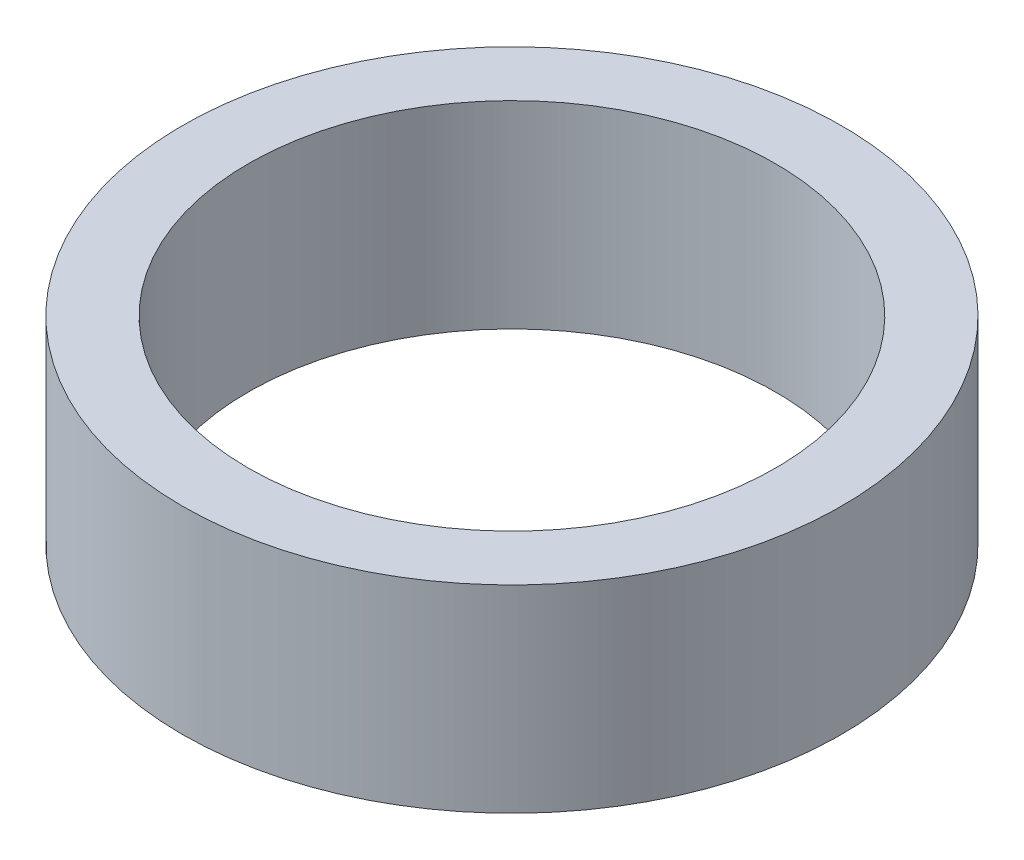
ISO-10303-21;
HEADER;
FILE_DESCRIPTION(('STEP AP214'),'2;1');
FILE_NAME('part.step','',(''),(''),'','','');
FILE_SCHEMA(('AUTOMOTIVE_DESIGN { 1 0 10303 214 1 1 1 1 }'));
ENDSEC;
DATA;
#1=APPLICATION_CONTEXT('core data for automotive mechanical design processes');
#2=APPLICATION_PROTOCOL_DEFINITION('international standard','automotive_design',2000,#1);
#3=PRODUCT_CONTEXT('',#1,'mechanical');
#4=PRODUCT('Part','Part','',(#3));
#5=PRODUCT_RELATED_PRODUCT_CATEGORY('part','',(#4));
#6=PRODUCT_DEFINITION_FORMATION('','',#4);
#7=PRODUCT_DEFINITION_CONTEXT('part definition',#1,'design');
#8=PRODUCT_DEFINITION('design','',#6,#7);
#9=PRODUCT_DEFINITION_SHAPE('','',#8);
#10=(LENGTH_UNIT() NAMED_UNIT(*) SI_UNIT(.MILLI.,.METRE.));
#11=(NAMED_UNIT(*) PLANE_ANGLE_UNIT() SI_UNIT($,.RADIAN.));
#12=(NAMED_UNIT(*) SI_UNIT($,.STERADIAN.) SOLID_ANGLE_UNIT());
#13=UNCERTAINTY_MEASURE_WITH_UNIT(LENGTH_MEASURE(1.E-05),#10,'distance_accuracy_value','');
#14=(GEOMETRIC_REPRESENTATION_CONTEXT(3) GLOBAL_UNCERTAINTY_ASSIGNED_CONTEXT((#13)) GLOBAL_UNIT_ASSIGNED_CONTEXT((#10,
#11,#12)) REPRESENTATION_CONTEXT('',''));
#15=CARTESIAN_POINT('',(0.,0.,0.));
#16=DIRECTION('',(0.,0.,1.));
#17=DIRECTION('',(1.,0.,0.));
#18=AXIS2_PLACEMENT_3D('',#15,#16,#17);
#19=CARTESIAN_POINT('',(0.,3.,0.));
#20=DIRECTION('',(0.,-1.,0.));
#21=DIRECTION('',(0.,0.,-1.));
#22=AXIS2_PLACEMENT_3D('',#19,#20,#21);
#23=CYLINDRICAL_SURFACE('',#22,5.);
#24=CARTESIAN_POINT('',(0.,3.,0.));
#25=DIRECTION('',(0.,1.,0.));
#26=DIRECTION('',(0.,0.,1.));
#27=AXIS2_PLACEMENT_3D('',#24,#25,#26);
#28=CIRCLE('',#27,5.);
#29=CARTESIAN_POINT('',(0.,3.,5.));
#30=VERTEX_POINT('',#29);
#31=EDGE_CURVE('E10',#30,#30,#28,.T.);
#32=ORIENTED_EDGE('',*,*,#31,.F.);
#33=EDGE_LOOP('',(#32));
#34=FACE_BOUND('',#33,.T.);
#35=CARTESIAN_POINT('',(0.,0.,0.));
#36=DIRECTION('',(0.,1.,0.));
#37=DIRECTION('',(0.,0.,1.));
#38=AXIS2_PLACEMENT_3D('',#35,#36,#37);
#39=CIRCLE('',#38,5.);
#40=CARTESIAN_POINT('',(0.,0.,5.));
#41=VERTEX_POINT('',#40);
#42=EDGE_CURVE('E45',#41,#41,#39,.T.);
#43=ORIENTED_EDGE('',*,*,#42,.T.);
#44=EDGE_LOOP('',(#43));
#45=FACE_BOUND('',#44,.T.);
#46=ADVANCED_FACE('F39',(#34,#45),#23,.T.);
#47=CARTESIAN_POINT('',(0.,3.,0.));
#48=DIRECTION('',(0.,1.,0.));
#49=DIRECTION('',(0.,0.,1.));
#50=AXIS2_PLACEMENT_3D('',#47,#48,#49);
#51=PLANE('',#50);
#52=CARTESIAN_POINT('',(0.,3.,0.));
#53=DIRECTION('',(0.,1.,0.));
#54=DIRECTION('',(0.,0.,1.));
#55=AXIS2_PLACEMENT_3D('',#52,#53,#54);
#56=CIRCLE('',#55,4.);
#57=CARTESIAN_POINT('',(0.,3.,4.));
#58=VERTEX_POINT('',#57);
#59=EDGE_CURVE('E51',#58,#58,#56,.T.);
#60=ORIENTED_EDGE('',*,*,#59,.F.);
#61=EDGE_LOOP('',(#60));
#62=FACE_BOUND('',#61,.T.);
#63=ORIENTED_EDGE('',*,*,#31,.T.);
#64=EDGE_LOOP('',(#63));
#65=FACE_BOUND('',#64,.T.);
#66=ADVANCED_FACE('F66',(#62,#65),#51,.T.);
#67=CARTESIAN_POINT('',(0.,0.,0.));
#68=DIRECTION('',(0.,1.,0.));
#69=DIRECTION('',(0.,0.,1.));
#70=AXIS2_PLACEMENT_3D('',#67,#68,#69);
#71=PLANE('',#70);
#72=CARTESIAN_POINT('',(0.,0.,0.));
#73=DIRECTION('',(0.,1.,0.));
#74=DIRECTION('',(0.,0.,1.));
#75=AXIS2_PLACEMENT_3D('',#72,#73,#74);
#76=CIRCLE('',#75,4.);
#77=CARTESIAN_POINT('',(0.,0.,4.));
#78=VERTEX_POINT('',#77);
#79=EDGE_CURVE('E47',#78,#78,#76,.T.);
#80=ORIENTED_EDGE('',*,*,#79,.T.);
#81=EDGE_LOOP('',(#80));
#82=FACE_BOUND('',#81,.T.);
#83=ORIENTED_EDGE('',*,*,#42,.F.);
#84=EDGE_LOOP('',(#83));
#85=FACE_BOUND('',#84,.T.);
#86=ADVANCED_FACE('F60',(#82,#85),#71,.F.);
#87=CARTESIAN_POINT('',(0.,0.,0.));
#88=DIRECTION('',(0.,1.,0.));
#89=DIRECTION('',(0.,0.,1.));
#90=AXIS2_PLACEMENT_3D('',#87,#88,#89);
#91=CYLINDRICAL_SURFACE('',#90,4.);
#92=ORIENTED_EDGE('',*,*,#79,.F.);
#93=EDGE_LOOP('',(#92));
#94=FACE_BOUND('',#93,.T.);
#95=ORIENTED_EDGE('',*,*,#59,.T.);
#96=EDGE_LOOP('',(#95));
#97=FACE_BOUND('',#96,.T.);
#98=ADVANCED_FACE('F58',(#94,#97),#91,.F.);
#99=CLOSED_SHELL('',(#46,#66,#86,#98));
#100=MANIFOLD_SOLID_BREP('B2',#99);
#101=ADVANCED_BREP_SHAPE_REPRESENTATION('',(#18,#100),#14);
#102=SHAPE_DEFINITION_REPRESENTATION(#9,#101);
ENDSEC;
END-ISO-10303-21;
